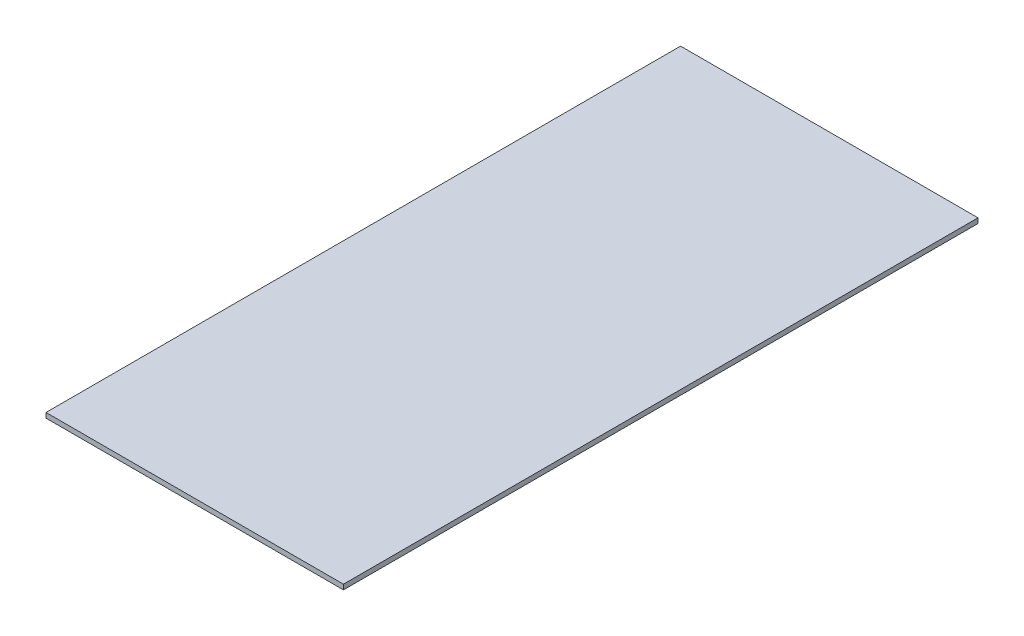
ISO-10303-21;
HEADER;
FILE_DESCRIPTION(('STEP AP214'),'2;1');
FILE_NAME('part.step','',(''),(''),'','','');
FILE_SCHEMA(('AUTOMOTIVE_DESIGN { 1 0 10303 214 1 1 1 1 }'));
ENDSEC;
DATA;
#1=APPLICATION_CONTEXT('core data for automotive mechanical design processes');
#2=APPLICATION_PROTOCOL_DEFINITION('international standard','automotive_design',2000,#1);
#3=PRODUCT_CONTEXT('',#1,'mechanical');
#4=PRODUCT('Part','Part','',(#3));
#5=PRODUCT_RELATED_PRODUCT_CATEGORY('part','',(#4));
#6=PRODUCT_DEFINITION_FORMATION('','',#4);
#7=PRODUCT_DEFINITION_CONTEXT('part definition',#1,'design');
#8=PRODUCT_DEFINITION('design','',#6,#7);
#9=PRODUCT_DEFINITION_SHAPE('','',#8);
#10=(LENGTH_UNIT() NAMED_UNIT(*) SI_UNIT(.MILLI.,.METRE.));
#11=(NAMED_UNIT(*) PLANE_ANGLE_UNIT() SI_UNIT($,.RADIAN.));
#12=(NAMED_UNIT(*) SI_UNIT($,.STERADIAN.) SOLID_ANGLE_UNIT());
#13=UNCERTAINTY_MEASURE_WITH_UNIT(LENGTH_MEASURE(1.E-05),#10,'distance_accuracy_value','');
#14=(GEOMETRIC_REPRESENTATION_CONTEXT(3) GLOBAL_UNCERTAINTY_ASSIGNED_CONTEXT((#13)) GLOBAL_UNIT_ASSIGNED_CONTEXT((#10,
#11,#12)) REPRESENTATION_CONTEXT('',''));
#15=CARTESIAN_POINT('',(0.,0.,0.));
#16=DIRECTION('',(0.,0.,1.));
#17=DIRECTION('',(1.,0.,0.));
#18=AXIS2_PLACEMENT_3D('',#15,#16,#17);
#19=CARTESIAN_POINT('',(0.,1.,0.));
#20=DIRECTION('',(1.,0.,0.));
#21=DIRECTION('',(0.,0.,-1.));
#22=AXIS2_PLACEMENT_3D('',#19,#20,#21);
#23=PLANE('',#22);
#24=DIRECTION('',(0.,0.,1.));
#25=VECTOR('',#24,1.);
#26=CARTESIAN_POINT('',(0.,0.,0.));
#27=LINE('',#26,#25);
#28=CARTESIAN_POINT('',(0.,0.,-128.));
#29=VERTEX_POINT('',#28);
#30=CARTESIAN_POINT('',(0.,0.,0.));
#31=VERTEX_POINT('',#30);
#32=EDGE_CURVE('E96',#29,#31,#27,.T.);
#33=ORIENTED_EDGE('',*,*,#32,.T.);
#34=DIRECTION('',(0.,-1.,0.));
#35=VECTOR('',#34,1.);
#36=CARTESIAN_POINT('',(0.,1.,0.));
#37=LINE('',#36,#35);
#38=CARTESIAN_POINT('',(0.,1.,0.));
#39=VERTEX_POINT('',#38);
#40=EDGE_CURVE('E11',#39,#31,#37,.T.);
#41=ORIENTED_EDGE('',*,*,#40,.F.);
#42=DIRECTION('',(0.,0.,1.));
#43=VECTOR('',#42,1.);
#44=CARTESIAN_POINT('',(0.,1.,0.));
#45=LINE('',#44,#43);
#46=CARTESIAN_POINT('',(0.,1.,-128.));
#47=VERTEX_POINT('',#46);
#48=EDGE_CURVE('E84',#47,#39,#45,.T.);
#49=ORIENTED_EDGE('',*,*,#48,.F.);
#50=DIRECTION('',(0.,-1.,0.));
#51=VECTOR('',#50,1.);
#52=CARTESIAN_POINT('',(0.,1.,-128.));
#53=LINE('',#52,#51);
#54=EDGE_CURVE('E92',#47,#29,#53,.T.);
#55=ORIENTED_EDGE('',*,*,#54,.T.);
#56=EDGE_LOOP('',(#33,#41,#49,#55));
#57=FACE_BOUND('',#56,.T.);
#58=ADVANCED_FACE('F33',(#57),#23,.F.);
#59=CARTESIAN_POINT('',(0.,1.,0.));
#60=DIRECTION('',(0.,0.,-1.));
#61=DIRECTION('',(-1.,0.,0.));
#62=AXIS2_PLACEMENT_3D('',#59,#60,#61);
#63=PLANE('',#62);
#64=DIRECTION('',(1.,0.,0.));
#65=VECTOR('',#64,1.);
#66=CARTESIAN_POINT('',(0.,0.,0.));
#67=LINE('',#66,#65);
#68=CARTESIAN_POINT('',(60.,0.,0.));
#69=VERTEX_POINT('',#68);
#70=EDGE_CURVE('E88',#31,#69,#67,.T.);
#71=ORIENTED_EDGE('',*,*,#70,.T.);
#72=DIRECTION('',(0.,-1.,0.));
#73=VECTOR('',#72,1.);
#74=CARTESIAN_POINT('',(60.,1.,0.));
#75=LINE('',#74,#73);
#76=CARTESIAN_POINT('',(60.,1.,0.));
#77=VERTEX_POINT('',#76);
#78=EDGE_CURVE('E41',#77,#69,#75,.T.);
#79=ORIENTED_EDGE('',*,*,#78,.F.);
#80=DIRECTION('',(1.,0.,0.));
#81=VECTOR('',#80,1.);
#82=CARTESIAN_POINT('',(0.,1.,0.));
#83=LINE('',#82,#81);
#84=EDGE_CURVE('E79',#39,#77,#83,.T.);
#85=ORIENTED_EDGE('',*,*,#84,.F.);
#86=ORIENTED_EDGE('',*,*,#40,.T.);
#87=EDGE_LOOP('',(#71,#79,#85,#86));
#88=FACE_BOUND('',#87,.T.);
#89=ADVANCED_FACE('F87',(#88),#63,.F.);
#90=CARTESIAN_POINT('',(60.,1.,0.));
#91=DIRECTION('',(-1.,0.,0.));
#92=DIRECTION('',(0.,0.,1.));
#93=AXIS2_PLACEMENT_3D('',#90,#91,#92);
#94=PLANE('',#93);
#95=DIRECTION('',(0.,0.,-1.));
#96=VECTOR('',#95,1.);
#97=CARTESIAN_POINT('',(60.,0.,0.));
#98=LINE('',#97,#96);
#99=CARTESIAN_POINT('',(60.,0.,-128.));
#100=VERTEX_POINT('',#99);
#101=EDGE_CURVE('E66',#69,#100,#98,.T.);
#102=ORIENTED_EDGE('',*,*,#101,.T.);
#103=DIRECTION('',(0.,-1.,0.));
#104=VECTOR('',#103,1.);
#105=CARTESIAN_POINT('',(60.,1.,-128.));
#106=LINE('',#105,#104);
#107=CARTESIAN_POINT('',(60.,1.,-128.));
#108=VERTEX_POINT('',#107);
#109=EDGE_CURVE('E89',#108,#100,#106,.T.);
#110=ORIENTED_EDGE('',*,*,#109,.F.);
#111=DIRECTION('',(0.,0.,-1.));
#112=VECTOR('',#111,1.);
#113=CARTESIAN_POINT('',(60.,1.,0.));
#114=LINE('',#113,#112);
#115=EDGE_CURVE('E82',#77,#108,#114,.T.);
#116=ORIENTED_EDGE('',*,*,#115,.F.);
#117=ORIENTED_EDGE('',*,*,#78,.T.);
#118=EDGE_LOOP('',(#102,#110,#116,#117));
#119=FACE_BOUND('',#118,.T.);
#120=ADVANCED_FACE('F90',(#119),#94,.F.);
#121=CARTESIAN_POINT('',(0.,1.,-128.));
#122=DIRECTION('',(0.,0.,1.));
#123=DIRECTION('',(1.,0.,0.));
#124=AXIS2_PLACEMENT_3D('',#121,#122,#123);
#125=PLANE('',#124);
#126=DIRECTION('',(-1.,0.,0.));
#127=VECTOR('',#126,1.);
#128=CARTESIAN_POINT('',(0.,0.,-128.));
#129=LINE('',#128,#127);
#130=EDGE_CURVE('E72',#100,#29,#129,.T.);
#131=ORIENTED_EDGE('',*,*,#130,.T.);
#132=ORIENTED_EDGE('',*,*,#54,.F.);
#133=DIRECTION('',(-1.,0.,0.));
#134=VECTOR('',#133,1.);
#135=CARTESIAN_POINT('',(0.,1.,-128.));
#136=LINE('',#135,#134);
#137=EDGE_CURVE('E49',#108,#47,#136,.T.);
#138=ORIENTED_EDGE('',*,*,#137,.F.);
#139=ORIENTED_EDGE('',*,*,#109,.T.);
#140=EDGE_LOOP('',(#131,#132,#138,#139));
#141=FACE_BOUND('',#140,.T.);
#142=ADVANCED_FACE('F103',(#141),#125,.F.);
#143=CARTESIAN_POINT('',(0.,1.,0.));
#144=DIRECTION('',(0.,-1.,0.));
#145=DIRECTION('',(0.,0.,-1.));
#146=AXIS2_PLACEMENT_3D('',#143,#144,#145);
#147=PLANE('',#146);
#148=ORIENTED_EDGE('',*,*,#48,.T.);
#149=ORIENTED_EDGE('',*,*,#84,.T.);
#150=ORIENTED_EDGE('',*,*,#115,.T.);
#151=ORIENTED_EDGE('',*,*,#137,.T.);
#152=EDGE_LOOP('',(#148,#149,#150,#151));
#153=FACE_BOUND('',#152,.T.);
#154=ADVANCED_FACE('F80',(#153),#147,.F.);
#155=CARTESIAN_POINT('',(0.,0.,0.));
#156=DIRECTION('',(0.,-1.,0.));
#157=DIRECTION('',(0.,0.,-1.));
#158=AXIS2_PLACEMENT_3D('',#155,#156,#157);
#159=PLANE('',#158);
#160=ORIENTED_EDGE('',*,*,#32,.F.);
#161=ORIENTED_EDGE('',*,*,#130,.F.);
#162=ORIENTED_EDGE('',*,*,#101,.F.);
#163=ORIENTED_EDGE('',*,*,#70,.F.);
#164=EDGE_LOOP('',(#160,#161,#162,#163));
#165=FACE_BOUND('',#164,.T.);
#166=ADVANCED_FACE('F106',(#165),#159,.T.);
#167=CLOSED_SHELL('',(#58,#89,#120,#142,#154,#166));
#168=MANIFOLD_SOLID_BREP('B2',#167);
#169=ADVANCED_BREP_SHAPE_REPRESENTATION('',(#18,#168),#14);
#170=SHAPE_DEFINITION_REPRESENTATION(#9,#169);
ENDSEC;
END-ISO-10303-21;
